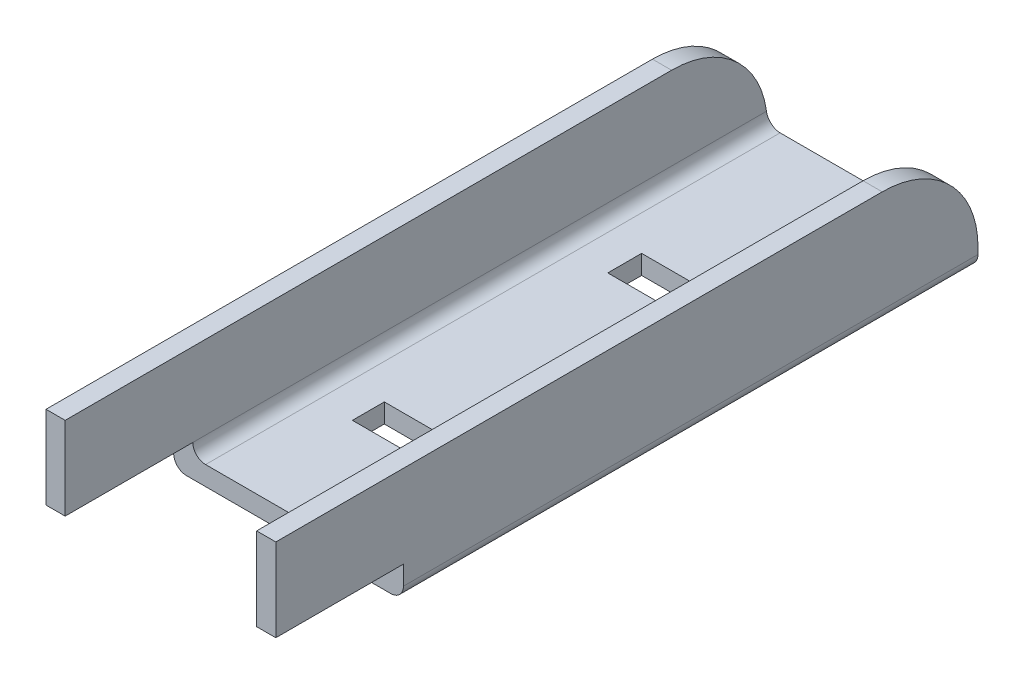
ISO-10303-21;
HEADER;
FILE_DESCRIPTION(('STEP AP214'),'2;1');
FILE_NAME('part.step','',(''),(''),'','','');
FILE_SCHEMA(('AUTOMOTIVE_DESIGN { 1 0 10303 214 1 1 1 1 }'));
ENDSEC;
DATA;
#1=APPLICATION_CONTEXT('core data for automotive mechanical design processes');
#2=APPLICATION_PROTOCOL_DEFINITION('international standard','automotive_design',2000,#1);
#3=PRODUCT_CONTEXT('',#1,'mechanical');
#4=PRODUCT('Part','Part','',(#3));
#5=PRODUCT_RELATED_PRODUCT_CATEGORY('part','',(#4));
#6=PRODUCT_DEFINITION_FORMATION('','',#4);
#7=PRODUCT_DEFINITION_CONTEXT('part definition',#1,'design');
#8=PRODUCT_DEFINITION('design','',#6,#7);
#9=PRODUCT_DEFINITION_SHAPE('','',#8);
#10=(LENGTH_UNIT() NAMED_UNIT(*) SI_UNIT(.MILLI.,.METRE.));
#11=(NAMED_UNIT(*) PLANE_ANGLE_UNIT() SI_UNIT($,.RADIAN.));
#12=(NAMED_UNIT(*) SI_UNIT($,.STERADIAN.) SOLID_ANGLE_UNIT());
#13=UNCERTAINTY_MEASURE_WITH_UNIT(LENGTH_MEASURE(1.E-05),#10,'distance_accuracy_value','');
#14=(GEOMETRIC_REPRESENTATION_CONTEXT(3) GLOBAL_UNCERTAINTY_ASSIGNED_CONTEXT((#13)) GLOBAL_UNIT_ASSIGNED_CONTEXT((#10,
#11,#12)) REPRESENTATION_CONTEXT('',''));
#15=CARTESIAN_POINT('',(0.,0.,0.));
#16=DIRECTION('',(0.,0.,1.));
#17=DIRECTION('',(1.,0.,0.));
#18=AXIS2_PLACEMENT_3D('',#15,#16,#17);
#19=CARTESIAN_POINT('',(33.,15.,0.));
#20=DIRECTION('',(0.,0.,-1.));
#21=DIRECTION('',(-1.,0.,0.));
#22=AXIS2_PLACEMENT_3D('',#19,#20,#21);
#23=PLANE('',#22);
#24=DIRECTION('',(0.,-1.,0.));
#25=VECTOR('',#24,1.);
#26=CARTESIAN_POINT('',(-3.,15.,0.));
#27=LINE('',#26,#25);
#28=CARTESIAN_POINT('',(-3.,15.,0.));
#29=VERTEX_POINT('',#28);
#30=CARTESIAN_POINT('',(-2.99999999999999,2.,0.));
#31=VERTEX_POINT('',#30);
#32=EDGE_CURVE('E273',#29,#31,#27,.T.);
#33=ORIENTED_EDGE('',*,*,#32,.T.);
#34=DIRECTION('',(1.,0.,0.));
#35=VECTOR('',#34,1.);
#36=CARTESIAN_POINT('',(33.,2.,0.));
#37=LINE('',#36,#35);
#38=CARTESIAN_POINT('',(0.,2.,0.));
#39=VERTEX_POINT('',#38);
#40=EDGE_CURVE('E308',#31,#39,#37,.T.);
#41=ORIENTED_EDGE('',*,*,#40,.T.);
#42=DIRECTION('',(0.,-1.,0.));
#43=VECTOR('',#42,1.);
#44=CARTESIAN_POINT('',(0.,15.,0.));
#45=LINE('',#44,#43);
#46=CARTESIAN_POINT('',(0.,15.,0.));
#47=VERTEX_POINT('',#46);
#48=EDGE_CURVE('E290',#47,#39,#45,.T.);
#49=ORIENTED_EDGE('',*,*,#48,.F.);
#50=DIRECTION('',(1.,0.,0.));
#51=VECTOR('',#50,1.);
#52=CARTESIAN_POINT('',(-3.,15.,0.));
#53=LINE('',#52,#51);
#54=EDGE_CURVE('E293',#29,#47,#53,.T.);
#55=ORIENTED_EDGE('',*,*,#54,.F.);
#56=EDGE_LOOP('',(#33,#41,#49,#55));
#57=FACE_BOUND('',#56,.T.);
#58=ADVANCED_FACE('F33',(#57),#23,.F.);
#59=CARTESIAN_POINT('',(33.,0.,-110.));
#60=DIRECTION('',(1.,0.,0.));
#61=DIRECTION('',(0.,0.,-1.));
#62=AXIS2_PLACEMENT_3D('',#59,#60,#61);
#63=PLANE('',#62);
#64=DIRECTION('',(0.,1.,0.));
#65=VECTOR('',#64,1.);
#66=CARTESIAN_POINT('',(33.,0.,-110.));
#67=LINE('',#66,#65);
#68=CARTESIAN_POINT('',(33.,-1.,-110.));
#69=VERTEX_POINT('',#68);
#70=CARTESIAN_POINT('',(33.,0.,-110.));
#71=VERTEX_POINT('',#70);
#72=EDGE_CURVE('E269',#69,#71,#67,.T.);
#73=ORIENTED_EDGE('',*,*,#72,.T.);
#74=CARTESIAN_POINT('',(33.,0.,-95.));
#75=DIRECTION('',(1.,0.,0.));
#76=DIRECTION('',(0.,0.,-1.));
#77=AXIS2_PLACEMENT_3D('',#74,#75,#76);
#78=CIRCLE('',#77,15.);
#79=CARTESIAN_POINT('',(33.,15.,-95.));
#80=VERTEX_POINT('',#79);
#81=EDGE_CURVE('E499',#71,#80,#78,.T.);
#82=ORIENTED_EDGE('',*,*,#81,.T.);
#83=DIRECTION('',(0.,0.,1.));
#84=VECTOR('',#83,1.);
#85=CARTESIAN_POINT('',(33.,15.,-110.));
#86=LINE('',#85,#84);
#87=CARTESIAN_POINT('',(33.,15.,0.));
#88=VERTEX_POINT('',#87);
#89=EDGE_CURVE('E281',#80,#88,#86,.T.);
#90=ORIENTED_EDGE('',*,*,#89,.T.);
#91=DIRECTION('',(0.,1.,0.));
#92=VECTOR('',#91,1.);
#93=CARTESIAN_POINT('',(33.,0.,0.));
#94=LINE('',#93,#92);
#95=CARTESIAN_POINT('',(33.,2.,0.));
#96=VERTEX_POINT('',#95);
#97=EDGE_CURVE('E268',#96,#88,#94,.T.);
#98=ORIENTED_EDGE('',*,*,#97,.F.);
#99=DIRECTION('',(0.,0.,1.));
#100=VECTOR('',#99,1.);
#101=CARTESIAN_POINT('',(33.,2.,0.));
#102=LINE('',#101,#100);
#103=CARTESIAN_POINT('',(33.,2.,-20.));
#104=VERTEX_POINT('',#103);
#105=EDGE_CURVE('E245',#104,#96,#102,.T.);
#106=ORIENTED_EDGE('',*,*,#105,.F.);
#107=DIRECTION('',(0.,1.,0.));
#108=VECTOR('',#107,1.);
#109=CARTESIAN_POINT('',(33.,-3.,-20.));
#110=LINE('',#109,#108);
#111=CARTESIAN_POINT('',(33.,-1.,-20.));
#112=VERTEX_POINT('',#111);
#113=EDGE_CURVE('E237',#112,#104,#110,.T.);
#114=ORIENTED_EDGE('',*,*,#113,.F.);
#115=DIRECTION('',(0.,0.,1.));
#116=VECTOR('',#115,1.);
#117=CARTESIAN_POINT('',(33.,-1.,-110.));
#118=LINE('',#117,#116);
#119=EDGE_CURVE('E324',#112,#69,#118,.F.);
#120=ORIENTED_EDGE('',*,*,#119,.T.);
#121=EDGE_LOOP('',(#73,#82,#90,#98,#106,#114,#120));
#122=FACE_BOUND('',#121,.T.);
#123=ADVANCED_FACE('F413',(#122),#63,.T.);
#124=CARTESIAN_POINT('',(0.,-3.,-110.));
#125=DIRECTION('',(0.,-1.,0.));
#126=DIRECTION('',(0.,0.,-1.));
#127=AXIS2_PLACEMENT_3D('',#124,#125,#126);
#128=PLANE('',#127);
#129=DIRECTION('',(0.,0.,-1.));
#130=VECTOR('',#129,1.);
#131=CARTESIAN_POINT('',(7.5,-3.,-37.5));
#132=LINE('',#131,#130);
#133=CARTESIAN_POINT('',(7.5,-3.,-37.5));
#134=VERTEX_POINT('',#133);
#135=CARTESIAN_POINT('',(7.5,-3.,-42.5));
#136=VERTEX_POINT('',#135);
#137=EDGE_CURVE('E49',#134,#136,#132,.T.);
#138=ORIENTED_EDGE('',*,*,#137,.F.);
#139=DIRECTION('',(-1.,0.,0.));
#140=VECTOR('',#139,1.);
#141=CARTESIAN_POINT('',(7.5,-3.,-37.5));
#142=LINE('',#141,#140);
#143=CARTESIAN_POINT('',(22.5,-3.,-37.5));
#144=VERTEX_POINT('',#143);
#145=EDGE_CURVE('E214',#144,#134,#142,.T.);
#146=ORIENTED_EDGE('',*,*,#145,.F.);
#147=DIRECTION('',(0.,0.,1.));
#148=VECTOR('',#147,1.);
#149=CARTESIAN_POINT('',(22.5,-3.,-37.5));
#150=LINE('',#149,#148);
#151=CARTESIAN_POINT('',(22.5,-3.,-42.5));
#152=VERTEX_POINT('',#151);
#153=EDGE_CURVE('E198',#152,#144,#150,.T.);
#154=ORIENTED_EDGE('',*,*,#153,.F.);
#155=DIRECTION('',(1.,0.,0.));
#156=VECTOR('',#155,1.);
#157=CARTESIAN_POINT('',(7.5,-3.,-42.5));
#158=LINE('',#157,#156);
#159=EDGE_CURVE('E207',#136,#152,#158,.T.);
#160=ORIENTED_EDGE('',*,*,#159,.F.);
#161=EDGE_LOOP('',(#138,#146,#154,#160));
#162=FACE_BOUND('',#161,.T.);
#163=DIRECTION('',(0.,0.,-1.));
#164=VECTOR('',#163,1.);
#165=CARTESIAN_POINT('',(7.5,-3.,-82.8066485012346));
#166=LINE('',#165,#164);
#167=CARTESIAN_POINT('',(7.5,-3.,-77.5));
#168=VERTEX_POINT('',#167);
#169=CARTESIAN_POINT('',(7.5,-3.,-82.8066485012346));
#170=VERTEX_POINT('',#169);
#171=EDGE_CURVE('E221',#168,#170,#166,.T.);
#172=ORIENTED_EDGE('',*,*,#171,.F.);
#173=DIRECTION('',(-1.,0.,0.));
#174=VECTOR('',#173,1.);
#175=CARTESIAN_POINT('',(7.5,-3.,-77.5));
#176=LINE('',#175,#174);
#177=CARTESIAN_POINT('',(22.5,-3.,-77.5));
#178=VERTEX_POINT('',#177);
#179=EDGE_CURVE('E231',#178,#168,#176,.T.);
#180=ORIENTED_EDGE('',*,*,#179,.F.);
#181=DIRECTION('',(0.,0.,1.));
#182=VECTOR('',#181,1.);
#183=CARTESIAN_POINT('',(22.5,-3.,-82.8066485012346));
#184=LINE('',#183,#182);
#185=CARTESIAN_POINT('',(22.5,-3.,-82.8066485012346));
#186=VERTEX_POINT('',#185);
#187=EDGE_CURVE('E228',#186,#178,#184,.T.);
#188=ORIENTED_EDGE('',*,*,#187,.F.);
#189=DIRECTION('',(1.,0.,0.));
#190=VECTOR('',#189,1.);
#191=CARTESIAN_POINT('',(7.5,-3.,-82.8066485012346));
#192=LINE('',#191,#190);
#193=EDGE_CURVE('E225',#170,#186,#192,.T.);
#194=ORIENTED_EDGE('',*,*,#193,.F.);
#195=EDGE_LOOP('',(#172,#180,#188,#194));
#196=FACE_BOUND('',#195,.T.);
#197=DIRECTION('',(1.,0.,0.));
#198=VECTOR('',#197,1.);
#199=CARTESIAN_POINT('',(0.,-3.,-110.));
#200=LINE('',#199,#198);
#201=CARTESIAN_POINT('',(-1.,-3.,-110.));
#202=VERTEX_POINT('',#201);
#203=CARTESIAN_POINT('',(31.,-3.,-110.));
#204=VERTEX_POINT('',#203);
#205=EDGE_CURVE('E278',#202,#204,#200,.T.);
#206=ORIENTED_EDGE('',*,*,#205,.T.);
#207=DIRECTION('',(0.,0.,1.));
#208=VECTOR('',#207,1.);
#209=CARTESIAN_POINT('',(31.,-3.,-110.));
#210=LINE('',#209,#208);
#211=CARTESIAN_POINT('',(31.,-3.,-20.));
#212=VERTEX_POINT('',#211);
#213=EDGE_CURVE('E319',#204,#212,#210,.T.);
#214=ORIENTED_EDGE('',*,*,#213,.T.);
#215=DIRECTION('',(1.,0.,0.));
#216=VECTOR('',#215,1.);
#217=CARTESIAN_POINT('',(-77.,-3.,-20.));
#218=LINE('',#217,#216);
#219=CARTESIAN_POINT('',(-1.,-3.,-20.));
#220=VERTEX_POINT('',#219);
#221=EDGE_CURVE('E247',#220,#212,#218,.T.);
#222=ORIENTED_EDGE('',*,*,#221,.F.);
#223=DIRECTION('',(0.,0.,1.));
#224=VECTOR('',#223,1.);
#225=CARTESIAN_POINT('',(-1.,-3.,-110.));
#226=LINE('',#225,#224);
#227=EDGE_CURVE('E314',#220,#202,#226,.F.);
#228=ORIENTED_EDGE('',*,*,#227,.T.);
#229=EDGE_LOOP('',(#206,#214,#222,#228));
#230=FACE_BOUND('',#229,.T.);
#231=ADVANCED_FACE('F211',(#162,#196,#230),#128,.T.);
#232=CARTESIAN_POINT('',(-3.,15.,-110.));
#233=DIRECTION('',(-1.,0.,0.));
#234=DIRECTION('',(0.,-1.,0.));
#235=AXIS2_PLACEMENT_3D('',#232,#233,#234);
#236=PLANE('',#235);
#237=DIRECTION('',(0.,0.,1.));
#238=VECTOR('',#237,1.);
#239=CARTESIAN_POINT('',(-3.,15.,-110.));
#240=LINE('',#239,#238);
#241=CARTESIAN_POINT('',(-3.,15.,-95.));
#242=VERTEX_POINT('',#241);
#243=EDGE_CURVE('E298',#242,#29,#240,.T.);
#244=ORIENTED_EDGE('',*,*,#243,.F.);
#245=CARTESIAN_POINT('',(-3.,0.,-95.));
#246=DIRECTION('',(-1.,0.,0.));
#247=DIRECTION('',(0.,-1.,0.));
#248=AXIS2_PLACEMENT_3D('',#245,#246,#247);
#249=CIRCLE('',#248,15.);
#250=CARTESIAN_POINT('',(-3.,0.,-110.));
#251=VERTEX_POINT('',#250);
#252=EDGE_CURVE('E474',#242,#251,#249,.T.);
#253=ORIENTED_EDGE('',*,*,#252,.T.);
#254=DIRECTION('',(0.,-1.,0.));
#255=VECTOR('',#254,1.);
#256=CARTESIAN_POINT('',(-3.,15.,-110.));
#257=LINE('',#256,#255);
#258=CARTESIAN_POINT('',(-3.,-1.,-110.));
#259=VERTEX_POINT('',#258);
#260=EDGE_CURVE('E276',#251,#259,#257,.T.);
#261=ORIENTED_EDGE('',*,*,#260,.T.);
#262=DIRECTION('',(0.,0.,1.));
#263=VECTOR('',#262,1.);
#264=CARTESIAN_POINT('',(-3.,-1.,-110.));
#265=LINE('',#264,#263);
#266=CARTESIAN_POINT('',(-3.,-1.,-20.));
#267=VERTEX_POINT('',#266);
#268=EDGE_CURVE('E309',#259,#267,#265,.T.);
#269=ORIENTED_EDGE('',*,*,#268,.T.);
#270=DIRECTION('',(0.,-1.,0.));
#271=VECTOR('',#270,1.);
#272=CARTESIAN_POINT('',(-3.,15.,-20.));
#273=LINE('',#272,#271);
#274=CARTESIAN_POINT('',(-3.,2.,-20.));
#275=VERTEX_POINT('',#274);
#276=EDGE_CURVE('E265',#275,#267,#273,.T.);
#277=ORIENTED_EDGE('',*,*,#276,.F.);
#278=DIRECTION('',(0.,0.,-1.));
#279=VECTOR('',#278,1.);
#280=CARTESIAN_POINT('',(-3.,2.,-110.));
#281=LINE('',#280,#279);
#282=EDGE_CURVE('E260',#31,#275,#281,.T.);
#283=ORIENTED_EDGE('',*,*,#282,.F.);
#284=ORIENTED_EDGE('',*,*,#32,.F.);
#285=EDGE_LOOP('',(#244,#253,#261,#269,#277,#283,#284));
#286=FACE_BOUND('',#285,.T.);
#287=ADVANCED_FACE('F490',(#286),#236,.T.);
#288=CARTESIAN_POINT('',(-3.,15.,-110.));
#289=DIRECTION('',(0.,-1.,0.));
#290=DIRECTION('',(0.,0.,-1.));
#291=AXIS2_PLACEMENT_3D('',#288,#289,#290);
#292=PLANE('',#291);
#293=DIRECTION('',(0.,0.,1.));
#294=VECTOR('',#293,1.);
#295=CARTESIAN_POINT('',(0.,15.,-110.));
#296=LINE('',#295,#294);
#297=CARTESIAN_POINT('',(0.,15.,-95.));
#298=VERTEX_POINT('',#297);
#299=EDGE_CURVE('E301',#298,#47,#296,.T.);
#300=ORIENTED_EDGE('',*,*,#299,.F.);
#301=DIRECTION('',(1.,0.,0.));
#302=VECTOR('',#301,1.);
#303=CARTESIAN_POINT('',(-3.,15.,-95.));
#304=LINE('',#303,#302);
#305=EDGE_CURVE('E503',#298,#242,#304,.F.);
#306=ORIENTED_EDGE('',*,*,#305,.T.);
#307=ORIENTED_EDGE('',*,*,#243,.T.);
#308=ORIENTED_EDGE('',*,*,#54,.T.);
#309=EDGE_LOOP('',(#300,#306,#307,#308));
#310=FACE_BOUND('',#309,.T.);
#311=ADVANCED_FACE('F547',(#310),#292,.F.);
#312=CARTESIAN_POINT('',(0.,15.,-110.));
#313=DIRECTION('',(-1.,0.,0.));
#314=DIRECTION('',(0.,-1.,0.));
#315=AXIS2_PLACEMENT_3D('',#312,#313,#314);
#316=PLANE('',#315);
#317=DIRECTION('',(0.,0.,1.));
#318=VECTOR('',#317,1.);
#319=CARTESIAN_POINT('',(0.,2.,-110.));
#320=LINE('',#319,#318);
#321=CARTESIAN_POINT('',(0.,2.,-20.));
#322=VERTEX_POINT('',#321);
#323=CARTESIAN_POINT('',(0.,2.,-109.866068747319));
#324=VERTEX_POINT('',#323);
#325=EDGE_CURVE('E331',#322,#324,#320,.F.);
#326=ORIENTED_EDGE('',*,*,#325,.T.);
#327=CARTESIAN_POINT('',(0.,0.,-95.));
#328=DIRECTION('',(-1.,0.,0.));
#329=DIRECTION('',(0.,-1.,0.));
#330=AXIS2_PLACEMENT_3D('',#327,#328,#329);
#331=CIRCLE('',#330,15.);
#332=EDGE_CURVE('E352',#324,#298,#331,.F.);
#333=ORIENTED_EDGE('',*,*,#332,.T.);
#334=ORIENTED_EDGE('',*,*,#299,.T.);
#335=ORIENTED_EDGE('',*,*,#48,.T.);
#336=DIRECTION('',(0.,0.,-1.));
#337=VECTOR('',#336,1.);
#338=CARTESIAN_POINT('',(0.,2.,-110.));
#339=LINE('',#338,#337);
#340=EDGE_CURVE('E257',#39,#322,#339,.T.);
#341=ORIENTED_EDGE('',*,*,#340,.T.);
#342=EDGE_LOOP('',(#326,#333,#334,#335,#341));
#343=FACE_BOUND('',#342,.T.);
#344=ADVANCED_FACE('F479',(#343),#316,.F.);
#345=CARTESIAN_POINT('',(0.,0.,-110.));
#346=DIRECTION('',(0.,-1.,0.));
#347=DIRECTION('',(0.,0.,-1.));
#348=AXIS2_PLACEMENT_3D('',#345,#346,#347);
#349=PLANE('',#348);
#350=DIRECTION('',(-1.,0.,0.));
#351=VECTOR('',#350,1.);
#352=CARTESIAN_POINT('',(0.,0.,-37.5));
#353=LINE('',#352,#351);
#354=CARTESIAN_POINT('',(22.5,0.,-37.5));
#355=VERTEX_POINT('',#354);
#356=CARTESIAN_POINT('',(7.5,0.,-37.5));
#357=VERTEX_POINT('',#356);
#358=EDGE_CURVE('E42',#355,#357,#353,.T.);
#359=ORIENTED_EDGE('',*,*,#358,.T.);
#360=DIRECTION('',(0.,0.,-1.));
#361=VECTOR('',#360,1.);
#362=CARTESIAN_POINT('',(7.50000000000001,0.,-110.));
#363=LINE('',#362,#361);
#364=CARTESIAN_POINT('',(7.5,0.,-42.5));
#365=VERTEX_POINT('',#364);
#366=EDGE_CURVE('E11',#357,#365,#363,.T.);
#367=ORIENTED_EDGE('',*,*,#366,.T.);
#368=DIRECTION('',(1.,0.,0.));
#369=VECTOR('',#368,1.);
#370=CARTESIAN_POINT('',(0.,0.,-42.5));
#371=LINE('',#370,#369);
#372=CARTESIAN_POINT('',(22.5,0.,-42.5));
#373=VERTEX_POINT('',#372);
#374=EDGE_CURVE('E389',#365,#373,#371,.T.);
#375=ORIENTED_EDGE('',*,*,#374,.T.);
#376=DIRECTION('',(0.,0.,1.));
#377=VECTOR('',#376,1.);
#378=CARTESIAN_POINT('',(22.5,0.,-110.));
#379=LINE('',#378,#377);
#380=EDGE_CURVE('E201',#373,#355,#379,.T.);
#381=ORIENTED_EDGE('',*,*,#380,.T.);
#382=EDGE_LOOP('',(#359,#367,#375,#381));
#383=FACE_BOUND('',#382,.T.);
#384=DIRECTION('',(-1.,0.,0.));
#385=VECTOR('',#384,1.);
#386=CARTESIAN_POINT('',(0.,0.,-77.5));
#387=LINE('',#386,#385);
#388=CARTESIAN_POINT('',(22.5,0.,-77.5));
#389=VERTEX_POINT('',#388);
#390=CARTESIAN_POINT('',(7.5,0.,-77.5));
#391=VERTEX_POINT('',#390);
#392=EDGE_CURVE('E383',#389,#391,#387,.T.);
#393=ORIENTED_EDGE('',*,*,#392,.T.);
#394=DIRECTION('',(0.,0.,-1.));
#395=VECTOR('',#394,1.);
#396=CARTESIAN_POINT('',(7.5,0.,-110.));
#397=LINE('',#396,#395);
#398=CARTESIAN_POINT('',(7.5,0.,-82.8066485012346));
#399=VERTEX_POINT('',#398);
#400=EDGE_CURVE('E386',#391,#399,#397,.T.);
#401=ORIENTED_EDGE('',*,*,#400,.T.);
#402=DIRECTION('',(1.,0.,0.));
#403=VECTOR('',#402,1.);
#404=CARTESIAN_POINT('',(0.,0.,-82.8066485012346));
#405=LINE('',#404,#403);
#406=CARTESIAN_POINT('',(22.5,0.,-82.8066485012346));
#407=VERTEX_POINT('',#406);
#408=EDGE_CURVE('E375',#399,#407,#405,.T.);
#409=ORIENTED_EDGE('',*,*,#408,.T.);
#410=DIRECTION('',(0.,0.,1.));
#411=VECTOR('',#410,1.);
#412=CARTESIAN_POINT('',(22.5,0.,-110.));
#413=LINE('',#412,#411);
#414=EDGE_CURVE('E380',#407,#389,#413,.T.);
#415=ORIENTED_EDGE('',*,*,#414,.T.);
#416=EDGE_LOOP('',(#393,#401,#409,#415));
#417=FACE_BOUND('',#416,.T.);
#418=DIRECTION('',(1.,0.,0.));
#419=VECTOR('',#418,1.);
#420=CARTESIAN_POINT('',(0.,0.,-20.));
#421=LINE('',#420,#419);
#422=CARTESIAN_POINT('',(2.,0.,-20.));
#423=VERTEX_POINT('',#422);
#424=CARTESIAN_POINT('',(28.,0.,-20.));
#425=VERTEX_POINT('',#424);
#426=EDGE_CURVE('E262',#423,#425,#421,.T.);
#427=ORIENTED_EDGE('',*,*,#426,.T.);
#428=DIRECTION('',(0.,0.,1.));
#429=VECTOR('',#428,1.);
#430=CARTESIAN_POINT('',(28.,0.,-110.));
#431=LINE('',#430,#429);
#432=CARTESIAN_POINT('',(28.,0.,-110.));
#433=VERTEX_POINT('',#432);
#434=EDGE_CURVE('E338',#425,#433,#431,.F.);
#435=ORIENTED_EDGE('',*,*,#434,.T.);
#436=DIRECTION('',(1.,0.,0.));
#437=VECTOR('',#436,1.);
#438=CARTESIAN_POINT('',(0.,0.,-110.));
#439=LINE('',#438,#437);
#440=CARTESIAN_POINT('',(2.,0.,-110.));
#441=VERTEX_POINT('',#440);
#442=EDGE_CURVE('E272',#441,#433,#439,.T.);
#443=ORIENTED_EDGE('',*,*,#442,.F.);
#444=DIRECTION('',(0.,0.,1.));
#445=VECTOR('',#444,1.);
#446=CARTESIAN_POINT('',(2.,0.,-20.));
#447=LINE('',#446,#445);
#448=EDGE_CURVE('E328',#441,#423,#447,.T.);
#449=ORIENTED_EDGE('',*,*,#448,.T.);
#450=EDGE_LOOP('',(#427,#435,#443,#449));
#451=FACE_BOUND('',#450,.T.);
#452=ADVANCED_FACE('F393',(#383,#417,#451),#349,.F.);
#453=CARTESIAN_POINT('',(30.,0.,-110.));
#454=DIRECTION('',(1.,0.,0.));
#455=DIRECTION('',(0.,0.,-1.));
#456=AXIS2_PLACEMENT_3D('',#453,#454,#455);
#457=PLANE('',#456);
#458=DIRECTION('',(0.,0.,1.));
#459=VECTOR('',#458,1.);
#460=CARTESIAN_POINT('',(30.,15.,-110.));
#461=LINE('',#460,#459);
#462=CARTESIAN_POINT('',(30.,15.,-95.));
#463=VERTEX_POINT('',#462);
#464=CARTESIAN_POINT('',(30.,15.,0.));
#465=VERTEX_POINT('',#464);
#466=EDGE_CURVE('E303',#463,#465,#461,.T.);
#467=ORIENTED_EDGE('',*,*,#466,.F.);
#468=CARTESIAN_POINT('',(30.,0.,-95.));
#469=DIRECTION('',(1.,0.,0.));
#470=DIRECTION('',(0.,0.,-1.));
#471=AXIS2_PLACEMENT_3D('',#468,#469,#470);
#472=CIRCLE('',#471,15.);
#473=CARTESIAN_POINT('',(30.,2.,-109.866068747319));
#474=VERTEX_POINT('',#473);
#475=EDGE_CURVE('E376',#463,#474,#472,.F.);
#476=ORIENTED_EDGE('',*,*,#475,.T.);
#477=DIRECTION('',(0.,0.,1.));
#478=VECTOR('',#477,1.);
#479=CARTESIAN_POINT('',(30.,2.,-20.));
#480=LINE('',#479,#478);
#481=CARTESIAN_POINT('',(30.,2.,-20.));
#482=VERTEX_POINT('',#481);
#483=EDGE_CURVE('E336',#474,#482,#480,.T.);
#484=ORIENTED_EDGE('',*,*,#483,.T.);
#485=DIRECTION('',(0.,0.,1.));
#486=VECTOR('',#485,1.);
#487=CARTESIAN_POINT('',(30.,2.,-110.));
#488=LINE('',#487,#486);
#489=CARTESIAN_POINT('',(30.,2.,0.));
#490=VERTEX_POINT('',#489);
#491=EDGE_CURVE('E254',#482,#490,#488,.T.);
#492=ORIENTED_EDGE('',*,*,#491,.T.);
#493=DIRECTION('',(0.,1.,0.));
#494=VECTOR('',#493,1.);
#495=CARTESIAN_POINT('',(30.,0.,0.));
#496=LINE('',#495,#494);
#497=EDGE_CURVE('E287',#490,#465,#496,.T.);
#498=ORIENTED_EDGE('',*,*,#497,.T.);
#499=EDGE_LOOP('',(#467,#476,#484,#492,#498));
#500=FACE_BOUND('',#499,.T.);
#501=ADVANCED_FACE('F442',(#500),#457,.F.);
#502=CARTESIAN_POINT('',(30.,15.,-110.));
#503=DIRECTION('',(0.,-1.,0.));
#504=DIRECTION('',(0.,0.,-1.));
#505=AXIS2_PLACEMENT_3D('',#502,#503,#504);
#506=PLANE('',#505);
#507=ORIENTED_EDGE('',*,*,#89,.F.);
#508=DIRECTION('',(1.,0.,0.));
#509=VECTOR('',#508,1.);
#510=CARTESIAN_POINT('',(30.,15.,-95.));
#511=LINE('',#510,#509);
#512=EDGE_CURVE('E501',#80,#463,#511,.F.);
#513=ORIENTED_EDGE('',*,*,#512,.T.);
#514=ORIENTED_EDGE('',*,*,#466,.T.);
#515=DIRECTION('',(1.,0.,0.));
#516=VECTOR('',#515,1.);
#517=CARTESIAN_POINT('',(30.,15.,0.));
#518=LINE('',#517,#516);
#519=EDGE_CURVE('E284',#465,#88,#518,.T.);
#520=ORIENTED_EDGE('',*,*,#519,.T.);
#521=EDGE_LOOP('',(#507,#513,#514,#520));
#522=FACE_BOUND('',#521,.T.);
#523=ADVANCED_FACE('F435',(#522),#506,.F.);
#524=CARTESIAN_POINT('',(33.,15.,-110.));
#525=DIRECTION('',(0.,0.,-1.));
#526=DIRECTION('',(-1.,0.,0.));
#527=AXIS2_PLACEMENT_3D('',#524,#525,#526);
#528=PLANE('',#527);
#529=ORIENTED_EDGE('',*,*,#442,.T.);
#530=DIRECTION('',(1.,0.,0.));
#531=VECTOR('',#530,1.);
#532=CARTESIAN_POINT('',(33.,0.,-110.));
#533=LINE('',#532,#531);
#534=EDGE_CURVE('E495',#433,#71,#533,.T.);
#535=ORIENTED_EDGE('',*,*,#534,.T.);
#536=ORIENTED_EDGE('',*,*,#72,.F.);
#537=CARTESIAN_POINT('',(31.,-1.,-110.));
#538=DIRECTION('',(0.,0.,-1.));
#539=DIRECTION('',(-1.,0.,0.));
#540=AXIS2_PLACEMENT_3D('',#537,#538,#539);
#541=CIRCLE('',#540,2.);
#542=EDGE_CURVE('E326',#69,#204,#541,.T.);
#543=ORIENTED_EDGE('',*,*,#542,.T.);
#544=ORIENTED_EDGE('',*,*,#205,.F.);
#545=CARTESIAN_POINT('',(-1.,-1.,-110.));
#546=DIRECTION('',(0.,0.,-1.));
#547=DIRECTION('',(-1.,0.,0.));
#548=AXIS2_PLACEMENT_3D('',#545,#546,#547);
#549=CIRCLE('',#548,2.);
#550=EDGE_CURVE('E316',#202,#259,#549,.T.);
#551=ORIENTED_EDGE('',*,*,#550,.T.);
#552=ORIENTED_EDGE('',*,*,#260,.F.);
#553=DIRECTION('',(1.,0.,0.));
#554=VECTOR('',#553,1.);
#555=CARTESIAN_POINT('',(0.,0.,-110.));
#556=LINE('',#555,#554);
#557=EDGE_CURVE('E343',#251,#441,#556,.T.);
#558=ORIENTED_EDGE('',*,*,#557,.T.);
#559=EDGE_LOOP('',(#529,#535,#536,#543,#544,#551,#552,#558));
#560=FACE_BOUND('',#559,.T.);
#561=ADVANCED_FACE('F426',(#560),#528,.T.);
#562=ORIENTED_EDGE('',*,*,#497,.F.);
#563=EDGE_CURVE('E300',#490,#96,#37,.T.);
#564=ORIENTED_EDGE('',*,*,#563,.T.);
#565=ORIENTED_EDGE('',*,*,#97,.T.);
#566=ORIENTED_EDGE('',*,*,#519,.F.);
#567=EDGE_LOOP('',(#562,#564,#565,#566));
#568=FACE_BOUND('',#567,.T.);
#569=ADVANCED_FACE('F416',(#568),#23,.F.);
#570=CARTESIAN_POINT('',(-77.,-3.,-20.));
#571=DIRECTION('',(0.,0.,-1.));
#572=DIRECTION('',(-1.,0.,0.));
#573=AXIS2_PLACEMENT_3D('',#570,#571,#572);
#574=PLANE('',#573);
#575=ORIENTED_EDGE('',*,*,#221,.T.);
#576=CARTESIAN_POINT('',(31.,-1.,-20.));
#577=DIRECTION('',(0.,0.,-1.));
#578=DIRECTION('',(-1.,0.,0.));
#579=AXIS2_PLACEMENT_3D('',#576,#577,#578);
#580=CIRCLE('',#579,2.);
#581=EDGE_CURVE('E322',#212,#112,#580,.F.);
#582=ORIENTED_EDGE('',*,*,#581,.T.);
#583=ORIENTED_EDGE('',*,*,#113,.T.);
#584=DIRECTION('',(1.,0.,0.));
#585=VECTOR('',#584,1.);
#586=CARTESIAN_POINT('',(-77.,2.,-20.));
#587=LINE('',#586,#585);
#588=EDGE_CURVE('E248',#482,#104,#587,.T.);
#589=ORIENTED_EDGE('',*,*,#588,.F.);
#590=CARTESIAN_POINT('',(28.,2.,-20.));
#591=DIRECTION('',(0.,0.,-1.));
#592=DIRECTION('',(-1.,0.,0.));
#593=AXIS2_PLACEMENT_3D('',#590,#591,#592);
#594=CIRCLE('',#593,2.);
#595=EDGE_CURVE('E341',#482,#425,#594,.T.);
#596=ORIENTED_EDGE('',*,*,#595,.T.);
#597=ORIENTED_EDGE('',*,*,#426,.F.);
#598=CARTESIAN_POINT('',(2.,2.,-20.));
#599=DIRECTION('',(0.,0.,-1.));
#600=DIRECTION('',(-1.,0.,0.));
#601=AXIS2_PLACEMENT_3D('',#598,#599,#600);
#602=CIRCLE('',#601,2.);
#603=EDGE_CURVE('E334',#423,#322,#602,.T.);
#604=ORIENTED_EDGE('',*,*,#603,.T.);
#605=EDGE_CURVE('E251',#275,#322,#587,.T.);
#606=ORIENTED_EDGE('',*,*,#605,.F.);
#607=ORIENTED_EDGE('',*,*,#276,.T.);
#608=CARTESIAN_POINT('',(-1.,-1.,-20.));
#609=DIRECTION('',(0.,0.,-1.));
#610=DIRECTION('',(-1.,0.,0.));
#611=AXIS2_PLACEMENT_3D('',#608,#609,#610);
#612=CIRCLE('',#611,2.);
#613=EDGE_CURVE('E312',#267,#220,#612,.F.);
#614=ORIENTED_EDGE('',*,*,#613,.T.);
#615=EDGE_LOOP('',(#575,#582,#583,#589,#596,#597,#604,#606,#607,#614));
#616=FACE_BOUND('',#615,.T.);
#617=ADVANCED_FACE('F425',(#616),#574,.F.);
#618=CARTESIAN_POINT('',(-77.,2.,0.));
#619=DIRECTION('',(0.,1.,0.));
#620=DIRECTION('',(0.,0.,1.));
#621=AXIS2_PLACEMENT_3D('',#618,#619,#620);
#622=PLANE('',#621);
#623=ORIENTED_EDGE('',*,*,#282,.T.);
#624=ORIENTED_EDGE('',*,*,#605,.T.);
#625=ORIENTED_EDGE('',*,*,#340,.F.);
#626=ORIENTED_EDGE('',*,*,#40,.F.);
#627=EDGE_LOOP('',(#623,#624,#625,#626));
#628=FACE_BOUND('',#627,.T.);
#629=ADVANCED_FACE('F432',(#628),#622,.F.);
#630=ORIENTED_EDGE('',*,*,#588,.T.);
#631=ORIENTED_EDGE('',*,*,#105,.T.);
#632=ORIENTED_EDGE('',*,*,#563,.F.);
#633=ORIENTED_EDGE('',*,*,#491,.F.);
#634=EDGE_LOOP('',(#630,#631,#632,#633));
#635=FACE_BOUND('',#634,.T.);
#636=ADVANCED_FACE('F449',(#635),#622,.F.);
#637=CARTESIAN_POINT('',(-1.,-1.,-110.));
#638=DIRECTION('',(0.,0.,1.));
#639=DIRECTION('',(1.,0.,0.));
#640=AXIS2_PLACEMENT_3D('',#637,#638,#639);
#641=CYLINDRICAL_SURFACE('',#640,2.);
#642=ORIENTED_EDGE('',*,*,#550,.F.);
#643=ORIENTED_EDGE('',*,*,#227,.F.);
#644=ORIENTED_EDGE('',*,*,#613,.F.);
#645=ORIENTED_EDGE('',*,*,#268,.F.);
#646=EDGE_LOOP('',(#642,#643,#644,#645));
#647=FACE_BOUND('',#646,.T.);
#648=ADVANCED_FACE('F465',(#647),#641,.T.);
#649=CARTESIAN_POINT('',(31.,-1.,-110.));
#650=DIRECTION('',(0.,0.,1.));
#651=DIRECTION('',(1.,0.,0.));
#652=AXIS2_PLACEMENT_3D('',#649,#650,#651);
#653=CYLINDRICAL_SURFACE('',#652,2.);
#654=ORIENTED_EDGE('',*,*,#542,.F.);
#655=ORIENTED_EDGE('',*,*,#119,.F.);
#656=ORIENTED_EDGE('',*,*,#581,.F.);
#657=ORIENTED_EDGE('',*,*,#213,.F.);
#658=EDGE_LOOP('',(#654,#655,#656,#657));
#659=FACE_BOUND('',#658,.T.);
#660=ADVANCED_FACE('F362',(#659),#653,.T.);
#661=CARTESIAN_POINT('',(2.,2.,-110.));
#662=DIRECTION('',(0.,0.,-1.));
#663=DIRECTION('',(-1.,0.,0.));
#664=AXIS2_PLACEMENT_3D('',#661,#662,#663);
#665=CYLINDRICAL_SURFACE('',#664,2.);
#666=ORIENTED_EDGE('',*,*,#448,.F.);
#667=CARTESIAN_POINT('',(2.,0.,-110.));
#668=CARTESIAN_POINT('',(1.94374039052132,3.75480187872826E-07,-109.999998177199));
#669=CARTESIAN_POINT('',(1.88750773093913,0.00237534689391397,-110.00000020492));
#670=CARTESIAN_POINT('',(1.77544462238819,0.0118500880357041,-109.999996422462));
#671=CARTESIAN_POINT('',(1.71961415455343,0.0189496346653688,-109.999990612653));
#672=CARTESIAN_POINT('',(1.55341997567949,0.0472683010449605,-109.999938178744));
#673=CARTESIAN_POINT('',(1.44416915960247,0.0755076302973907,-109.999856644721));
#674=CARTESIAN_POINT('',(1.23196064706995,0.149923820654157,-109.999296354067));
#675=CARTESIAN_POINT('',(1.12900606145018,0.196109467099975,-109.998817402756));
#676=CARTESIAN_POINT('',(0.93231806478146,0.305099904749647,-109.996995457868));
#677=CARTESIAN_POINT('',(0.838583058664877,0.367901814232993,-109.995652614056));
#678=CARTESIAN_POINT('',(0.663070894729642,0.5082756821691,-109.99154987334));
#679=CARTESIAN_POINT('',(0.581284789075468,0.585836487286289,-109.988791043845));
#680=CARTESIAN_POINT('',(0.431901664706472,0.753534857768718,-109.981295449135));
#681=CARTESIAN_POINT('',(0.364306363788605,0.843673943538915,-109.976558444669));
#682=CARTESIAN_POINT('',(0.245409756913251,1.03359778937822,-109.964648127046));
#683=CARTESIAN_POINT('',(0.194061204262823,1.13335345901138,-109.957482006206));
#684=CARTESIAN_POINT('',(0.108804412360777,1.33982062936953,-109.940401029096));
#685=CARTESIAN_POINT('',(0.0748881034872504,1.44652888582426,-109.93048744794));
#686=CARTESIAN_POINT('',(0.0334270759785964,1.62821337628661,-109.9115503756));
#687=CARTESIAN_POINT('',(0.0208871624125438,1.70217094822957,-109.903293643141));
#688=CARTESIAN_POINT('',(0.0041741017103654,1.8507697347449,-109.885573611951));
#689=CARTESIAN_POINT('',(-1.15014222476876E-05,1.92540976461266,-109.8761121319));
#690=CARTESIAN_POINT('',(0.,2.,-109.866068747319));
#691=B_SPLINE_CURVE_WITH_KNOTS('',3,(#667,#668,#669,#670,#671,#672,#673,#674,#675,#676,#677,
#678,#679,#680,#681,#682,#683,#684,#685,#686,#687,#688,#689,#690),.UNSPECIFIED.,.F.,.F.,(4,2,2,
2,2,2,2,2,2,2,2,4),(0.,0.168675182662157,0.337342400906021,0.674130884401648,1.01108444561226,
1.34797960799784,1.68462118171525,2.0213034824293,2.35699749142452,2.69253596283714,
2.91848729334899,3.14410148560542),.UNSPECIFIED.);
#692=EDGE_CURVE('E346',#441,#324,#691,.T.);
#693=ORIENTED_EDGE('',*,*,#692,.T.);
#694=ORIENTED_EDGE('',*,*,#325,.F.);
#695=ORIENTED_EDGE('',*,*,#603,.F.);
#696=EDGE_LOOP('',(#666,#693,#694,#695));
#697=FACE_BOUND('',#696,.T.);
#698=ADVANCED_FACE('F357',(#697),#665,.F.);
#699=CARTESIAN_POINT('',(28.,2.,-110.));
#700=DIRECTION('',(0.,0.,-1.));
#701=DIRECTION('',(-1.,0.,0.));
#702=AXIS2_PLACEMENT_3D('',#699,#700,#701);
#703=CYLINDRICAL_SURFACE('',#702,2.);
#704=ORIENTED_EDGE('',*,*,#483,.F.);
#705=CARTESIAN_POINT('',(30.,2.,-109.866068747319));
#706=CARTESIAN_POINT('',(29.9999996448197,1.94428057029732,-109.873566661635));
#707=CARTESIAN_POINT('',(29.9976699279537,1.88854367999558,-109.880744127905));
#708=CARTESIAN_POINT('',(29.9883545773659,1.77737752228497,-109.894430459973));
#709=CARTESIAN_POINT('',(29.9813688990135,1.72194825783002,-109.900939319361));
#710=CARTESIAN_POINT('',(29.9534607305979,1.55680617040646,-109.919402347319));
#711=CARTESIAN_POINT('',(29.9255870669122,1.44806623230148,-109.930316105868));
#712=CARTESIAN_POINT('',(29.8519403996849,1.23653030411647,-109.949324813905));
#713=CARTESIAN_POINT('',(29.806153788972,1.13373890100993,-109.957417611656));
#714=CARTESIAN_POINT('',(29.6979268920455,0.937163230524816,-109.971019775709));
#715=CARTESIAN_POINT('',(29.6354910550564,0.843376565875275,-109.976529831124));
#716=CARTESIAN_POINT('',(29.4960464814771,0.667954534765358,-109.985377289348));
#717=CARTESIAN_POINT('',(29.4191067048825,0.586264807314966,-109.988724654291));
#718=CARTESIAN_POINT('',(29.2526162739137,0.436841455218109,-109.993824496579));
#719=CARTESIAN_POINT('',(29.1630627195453,0.369111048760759,-109.995576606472));
#720=CARTESIAN_POINT('',(28.9736942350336,0.249429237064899,-109.998046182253));
#721=CARTESIAN_POINT('',(28.8738574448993,0.197512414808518,-109.998761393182));
#722=CARTESIAN_POINT('',(28.6669190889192,0.111145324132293,-109.999650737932));
#723=CARTESIAN_POINT('',(28.5598214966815,0.0766855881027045,-109.999825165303));
#724=CARTESIAN_POINT('',(28.3767826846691,0.0343461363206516,-109.99997045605));
#725=CARTESIAN_POINT('',(28.3019570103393,0.0214755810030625,-109.999988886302));
#726=CARTESIAN_POINT('',(28.151431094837,0.00430258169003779,-110.00000004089));
#727=CARTESIAN_POINT('',(28.0757321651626,-1.13618963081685E-05,-109.999992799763));
#728=CARTESIAN_POINT('',(28.,0.,-110.));
#729=B_SPLINE_CURVE_WITH_KNOTS('',3,(#705,#706,#707,#708,#709,#710,#711,#712,#713,#714,#715,
#716,#717,#718,#719,#720,#721,#722,#723,#724,#725,#726,#727,#728),.UNSPECIFIED.,.F.,.F.,(4,2,2,
2,2,2,2,2,2,2,2,4),(0.,0.168564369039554,0.33713035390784,0.673745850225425,1.01061754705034,
1.34739931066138,1.68261846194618,2.01791480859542,2.35393924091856,2.68978123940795,
2.91709622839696,3.14410551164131),.UNSPECIFIED.);
#730=EDGE_CURVE('E369',#474,#433,#729,.T.);
#731=ORIENTED_EDGE('',*,*,#730,.T.);
#732=ORIENTED_EDGE('',*,*,#434,.F.);
#733=ORIENTED_EDGE('',*,*,#595,.F.);
#734=EDGE_LOOP('',(#704,#731,#732,#733));
#735=FACE_BOUND('',#734,.T.);
#736=ADVANCED_FACE('F361',(#735),#703,.F.);
#737=CARTESIAN_POINT('',(33.,0.,-95.));
#738=DIRECTION('',(-1.,0.,0.));
#739=DIRECTION('',(0.,0.,1.));
#740=AXIS2_PLACEMENT_3D('',#737,#738,#739);
#741=CYLINDRICAL_SURFACE('',#740,15.);
#742=ORIENTED_EDGE('',*,*,#252,.F.);
#743=ORIENTED_EDGE('',*,*,#305,.F.);
#744=ORIENTED_EDGE('',*,*,#332,.F.);
#745=ORIENTED_EDGE('',*,*,#692,.F.);
#746=ORIENTED_EDGE('',*,*,#557,.F.);
#747=EDGE_LOOP('',(#742,#743,#744,#745,#746));
#748=FACE_BOUND('',#747,.T.);
#749=ADVANCED_FACE('F354',(#748),#741,.T.);
#750=CARTESIAN_POINT('',(33.,0.,-95.));
#751=DIRECTION('',(-1.,0.,0.));
#752=DIRECTION('',(0.,0.,1.));
#753=AXIS2_PLACEMENT_3D('',#750,#751,#752);
#754=CYLINDRICAL_SURFACE('',#753,15.);
#755=ORIENTED_EDGE('',*,*,#475,.F.);
#756=ORIENTED_EDGE('',*,*,#512,.F.);
#757=ORIENTED_EDGE('',*,*,#81,.F.);
#758=ORIENTED_EDGE('',*,*,#534,.F.);
#759=ORIENTED_EDGE('',*,*,#730,.F.);
#760=EDGE_LOOP('',(#755,#756,#757,#758,#759));
#761=FACE_BOUND('',#760,.T.);
#762=ADVANCED_FACE('F35',(#761),#754,.T.);
#763=CARTESIAN_POINT('',(7.5,107.,-82.8066485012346));
#764=DIRECTION('',(-1.,0.,0.));
#765=DIRECTION('',(0.,0.,1.));
#766=AXIS2_PLACEMENT_3D('',#763,#764,#765);
#767=PLANE('',#766);
#768=DIRECTION('',(0.,-1.,0.));
#769=VECTOR('',#768,1.);
#770=CARTESIAN_POINT('',(7.5,107.,-77.5));
#771=LINE('',#770,#769);
#772=EDGE_CURVE('E235',#391,#168,#771,.T.);
#773=ORIENTED_EDGE('',*,*,#772,.T.);
#774=ORIENTED_EDGE('',*,*,#171,.T.);
#775=DIRECTION('',(0.,-1.,0.));
#776=VECTOR('',#775,1.);
#777=CARTESIAN_POINT('',(7.5,107.,-82.8066485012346));
#778=LINE('',#777,#776);
#779=EDGE_CURVE('E234',#399,#170,#778,.T.);
#780=ORIENTED_EDGE('',*,*,#779,.F.);
#781=ORIENTED_EDGE('',*,*,#400,.F.);
#782=EDGE_LOOP('',(#773,#774,#780,#781));
#783=FACE_BOUND('',#782,.T.);
#784=ADVANCED_FACE('F524',(#783),#767,.F.);
#785=CARTESIAN_POINT('',(7.5,107.,-77.5));
#786=DIRECTION('',(0.,0.,1.));
#787=DIRECTION('',(1.,0.,0.));
#788=AXIS2_PLACEMENT_3D('',#785,#786,#787);
#789=PLANE('',#788);
#790=DIRECTION('',(0.,-1.,0.));
#791=VECTOR('',#790,1.);
#792=CARTESIAN_POINT('',(22.5,107.,-77.5));
#793=LINE('',#792,#791);
#794=EDGE_CURVE('E238',#389,#178,#793,.T.);
#795=ORIENTED_EDGE('',*,*,#794,.T.);
#796=ORIENTED_EDGE('',*,*,#179,.T.);
#797=ORIENTED_EDGE('',*,*,#772,.F.);
#798=ORIENTED_EDGE('',*,*,#392,.F.);
#799=EDGE_LOOP('',(#795,#796,#797,#798));
#800=FACE_BOUND('',#799,.T.);
#801=ADVANCED_FACE('F526',(#800),#789,.F.);
#802=CARTESIAN_POINT('',(22.5,107.,-82.8066485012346));
#803=DIRECTION('',(1.,0.,0.));
#804=DIRECTION('',(0.,0.,-1.));
#805=AXIS2_PLACEMENT_3D('',#802,#803,#804);
#806=PLANE('',#805);
#807=DIRECTION('',(0.,-1.,0.));
#808=VECTOR('',#807,1.);
#809=CARTESIAN_POINT('',(22.5,107.,-82.8066485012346));
#810=LINE('',#809,#808);
#811=EDGE_CURVE('E240',#407,#186,#810,.T.);
#812=ORIENTED_EDGE('',*,*,#811,.T.);
#813=ORIENTED_EDGE('',*,*,#187,.T.);
#814=ORIENTED_EDGE('',*,*,#794,.F.);
#815=ORIENTED_EDGE('',*,*,#414,.F.);
#816=EDGE_LOOP('',(#812,#813,#814,#815));
#817=FACE_BOUND('',#816,.T.);
#818=ADVANCED_FACE('F407',(#817),#806,.F.);
#819=CARTESIAN_POINT('',(7.5,107.,-82.8066485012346));
#820=DIRECTION('',(0.,0.,-1.));
#821=DIRECTION('',(-1.,0.,0.));
#822=AXIS2_PLACEMENT_3D('',#819,#820,#821);
#823=PLANE('',#822);
#824=ORIENTED_EDGE('',*,*,#779,.T.);
#825=ORIENTED_EDGE('',*,*,#193,.T.);
#826=ORIENTED_EDGE('',*,*,#811,.F.);
#827=ORIENTED_EDGE('',*,*,#408,.F.);
#828=EDGE_LOOP('',(#824,#825,#826,#827));
#829=FACE_BOUND('',#828,.T.);
#830=ADVANCED_FACE('F400',(#829),#823,.F.);
#831=CARTESIAN_POINT('',(7.5,107.,-37.5));
#832=DIRECTION('',(-1.,0.,0.));
#833=DIRECTION('',(0.,0.,1.));
#834=AXIS2_PLACEMENT_3D('',#831,#832,#833);
#835=PLANE('',#834);
#836=DIRECTION('',(0.,-1.,0.));
#837=VECTOR('',#836,1.);
#838=CARTESIAN_POINT('',(7.5,107.,-37.5));
#839=LINE('',#838,#837);
#840=EDGE_CURVE('E219',#357,#134,#839,.T.);
#841=ORIENTED_EDGE('',*,*,#840,.T.);
#842=ORIENTED_EDGE('',*,*,#137,.T.);
#843=DIRECTION('',(0.,-1.,0.));
#844=VECTOR('',#843,1.);
#845=CARTESIAN_POINT('',(7.5,107.,-42.5));
#846=LINE('',#845,#844);
#847=EDGE_CURVE('E204',#365,#136,#846,.T.);
#848=ORIENTED_EDGE('',*,*,#847,.F.);
#849=ORIENTED_EDGE('',*,*,#366,.F.);
#850=EDGE_LOOP('',(#841,#842,#848,#849));
#851=FACE_BOUND('',#850,.T.);
#852=ADVANCED_FACE('F398',(#851),#835,.F.);
#853=CARTESIAN_POINT('',(7.5,107.,-37.5));
#854=DIRECTION('',(0.,0.,1.));
#855=DIRECTION('',(1.,0.,0.));
#856=AXIS2_PLACEMENT_3D('',#853,#854,#855);
#857=PLANE('',#856);
#858=DIRECTION('',(0.,-1.,0.));
#859=VECTOR('',#858,1.);
#860=CARTESIAN_POINT('',(22.5,107.,-37.5));
#861=LINE('',#860,#859);
#862=EDGE_CURVE('E203',#355,#144,#861,.T.);
#863=ORIENTED_EDGE('',*,*,#862,.T.);
#864=ORIENTED_EDGE('',*,*,#145,.T.);
#865=ORIENTED_EDGE('',*,*,#840,.F.);
#866=ORIENTED_EDGE('',*,*,#358,.F.);
#867=EDGE_LOOP('',(#863,#864,#865,#866));
#868=FACE_BOUND('',#867,.T.);
#869=ADVANCED_FACE('F397',(#868),#857,.F.);
#870=CARTESIAN_POINT('',(22.5,107.,-37.5));
#871=DIRECTION('',(1.,0.,0.));
#872=DIRECTION('',(0.,0.,-1.));
#873=AXIS2_PLACEMENT_3D('',#870,#871,#872);
#874=PLANE('',#873);
#875=DIRECTION('',(0.,-1.,0.));
#876=VECTOR('',#875,1.);
#877=CARTESIAN_POINT('',(22.5,107.,-42.5));
#878=LINE('',#877,#876);
#879=EDGE_CURVE('E57',#373,#152,#878,.T.);
#880=ORIENTED_EDGE('',*,*,#879,.T.);
#881=ORIENTED_EDGE('',*,*,#153,.T.);
#882=ORIENTED_EDGE('',*,*,#862,.F.);
#883=ORIENTED_EDGE('',*,*,#380,.F.);
#884=EDGE_LOOP('',(#880,#881,#882,#883));
#885=FACE_BOUND('',#884,.T.);
#886=ADVANCED_FACE('F195',(#885),#874,.F.);
#887=CARTESIAN_POINT('',(7.5,107.,-42.5));
#888=DIRECTION('',(0.,0.,-1.));
#889=DIRECTION('',(-1.,0.,0.));
#890=AXIS2_PLACEMENT_3D('',#887,#888,#889);
#891=PLANE('',#890);
#892=ORIENTED_EDGE('',*,*,#847,.T.);
#893=ORIENTED_EDGE('',*,*,#159,.T.);
#894=ORIENTED_EDGE('',*,*,#879,.F.);
#895=ORIENTED_EDGE('',*,*,#374,.F.);
#896=EDGE_LOOP('',(#892,#893,#894,#895));
#897=FACE_BOUND('',#896,.T.);
#898=ADVANCED_FACE('F208',(#897),#891,.F.);
#899=CLOSED_SHELL('',(#58,#123,#231,#287,#311,#344,#452,#501,#523,#561,#569,#617,#629,#636,#648,
#660,#698,#736,#749,#762,#784,#801,#818,#830,#852,#869,#886,#898));
#900=MANIFOLD_SOLID_BREP('B2',#899);
#901=ADVANCED_BREP_SHAPE_REPRESENTATION('',(#18,#900),#14);
#902=SHAPE_DEFINITION_REPRESENTATION(#9,#901);
ENDSEC;
END-ISO-10303-21;
